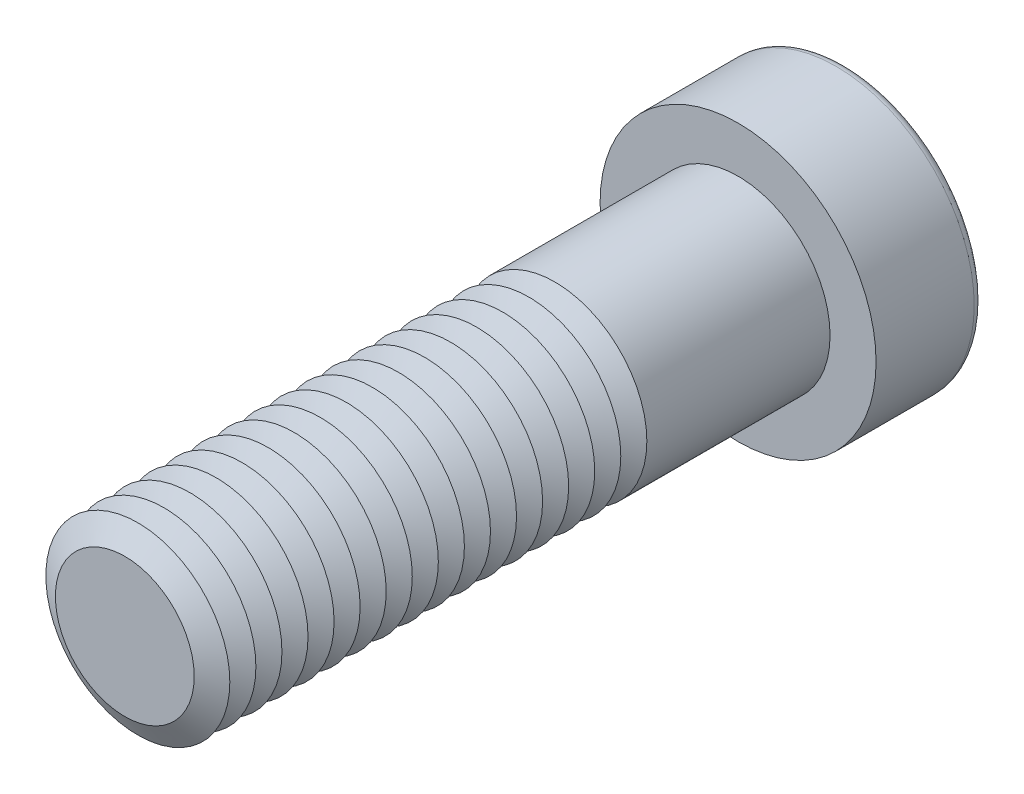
from build123d import *

# Parameters (mm, degrees)
SKETCH1_R           = 6
BOSS_EXTRUDE1_DEPTH = 40
SKETCH2_R           = 9
BOSS_EXTRUDE2_DEPTH = 7
CUT_EXTRUDE1_DEPTH  = 6
FILLET1_R           = 0.6
LPATTERN1_COUNT     = 17
LPATTERN1_PITCH     = 1.7


with BuildPart() as part:
    # Sketch1 → Boss-Extrude1 (new body)
    with BuildSketch(Plane.XY):
        Circle(SKETCH1_R)
    extrude(amount=BOSS_EXTRUDE1_DEPTH)

    # Sketch2 → Boss-Extrude2 (add)
    with BuildSketch(Plane(origin=(0, 0, 0), x_dir=(-1, 0, 0), z_dir=(0, 0, -1))):
        Circle(SKETCH2_R)
    extrude(amount=BOSS_EXTRUDE2_DEPTH)

    # Sketch3 → Cut-Extrude1 (cut)
    with BuildSketch(Plane(origin=(0, 0, -7), x_dir=(-1, 0, 0), z_dir=(0, 0, -1))):
        Polygon((-2.309401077, 4), (-4.618802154, 0), (-2.309401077, -4), (2.309401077, -4), (4.618802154, 0), (2.309401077, 4), align=None)
    extrude(amount=-CUT_EXTRUDE1_DEPTH, mode=Mode.SUBTRACT)

    # Fillet1
    fillet1_edges = [part.edges().sort_by_distance(p)[0] for p in [
        (9, 0, -7),
    ]]
    fillet(fillet1_edges, radius=FILLET1_R)

    # Cut-Extrude2 cone 1 section (on through the dimple's axis) → Cut-Extrude2 (revolve, cut)
    with BuildSketch(Plane(origin=(0, 0, -1), x_dir=(0, 1, 0), z_dir=(1, 0, 0))):
        Polygon((0, 0), (4, 0), (0, 2.309401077), align=None)
    revolve(axis=Axis((0, 0, -1), (0, 0, 1)), mode=Mode.SUBTRACT)

    # Cut-Extrude3 cone 1 section (on through the dimple's axis) → Cut-Extrude3 (revolve, cut)
    with BuildSketch(Plane(origin=(0, 0, -7), x_dir=(0, 1, 0), z_dir=(1, 0, 0))):
        Polygon((0, 0), (4.618802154, 0), (0, 1.237604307), align=None)
    revolve(axis=Axis((0, 0, -7), (0, 0, 1)), mode=Mode.SUBTRACT)

    # Sketch7 → Cut-Revolve1 (revolve, cut)
    with BuildSketch(Plane(origin=(0, 0, 0), x_dir=(0, 0, -1), z_dir=(1, 0, 0)), mode=Mode.PRIVATE) as cut_revolve1_sk:
        Polygon((-40, 4.527756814), (-39.15, 6), (-40.85, 6), align=None)
    cut_revolve1 = revolve(cut_revolve1_sk.sketch.rotate(Axis((0, 0, 40), (0, 0, -1)), 90), axis=Axis((0, 0, 40), (0, 0, -1)), mode=Mode.SUBTRACT)

    # LPattern1: Cut-Revolve1 ×17
    with Locations(*[(0, 0, -i * LPATTERN1_PITCH) for i in range(1, LPATTERN1_COUNT)]):
        add(cut_revolve1, mode=Mode.SUBTRACT)


solid = part.part
